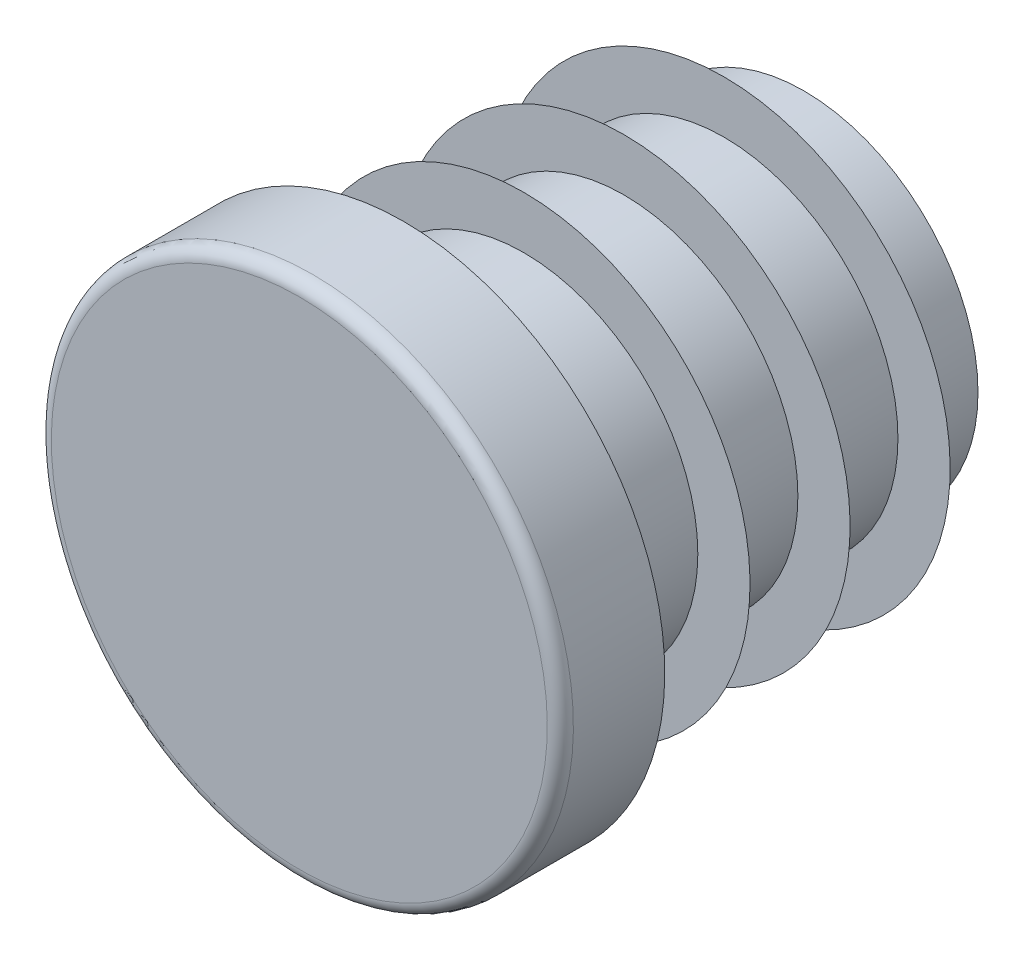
ISO-10303-21;
HEADER;
FILE_DESCRIPTION(('STEP AP214'),'2;1');
FILE_NAME('part.step','',(''),(''),'','','');
FILE_SCHEMA(('AUTOMOTIVE_DESIGN { 1 0 10303 214 1 1 1 1 }'));
ENDSEC;
DATA;
#1=APPLICATION_CONTEXT('core data for automotive mechanical design processes');
#2=APPLICATION_PROTOCOL_DEFINITION('international standard','automotive_design',2000,#1);
#3=PRODUCT_CONTEXT('',#1,'mechanical');
#4=PRODUCT('Part','Part','',(#3));
#5=PRODUCT_RELATED_PRODUCT_CATEGORY('part','',(#4));
#6=PRODUCT_DEFINITION_FORMATION('','',#4);
#7=PRODUCT_DEFINITION_CONTEXT('part definition',#1,'design');
#8=PRODUCT_DEFINITION('design','',#6,#7);
#9=PRODUCT_DEFINITION_SHAPE('','',#8);
#10=(LENGTH_UNIT() NAMED_UNIT(*) SI_UNIT(.MILLI.,.METRE.));
#11=(NAMED_UNIT(*) PLANE_ANGLE_UNIT() SI_UNIT($,.RADIAN.));
#12=(NAMED_UNIT(*) SI_UNIT($,.STERADIAN.) SOLID_ANGLE_UNIT());
#13=UNCERTAINTY_MEASURE_WITH_UNIT(LENGTH_MEASURE(1.E-05),#10,'distance_accuracy_value','');
#14=(GEOMETRIC_REPRESENTATION_CONTEXT(3) GLOBAL_UNCERTAINTY_ASSIGNED_CONTEXT((#13)) GLOBAL_UNIT_ASSIGNED_CONTEXT((#10,
#11,#12)) REPRESENTATION_CONTEXT('',''));
#15=CARTESIAN_POINT('',(0.,0.,0.));
#16=DIRECTION('',(0.,0.,1.));
#17=DIRECTION('',(1.,0.,0.));
#18=AXIS2_PLACEMENT_3D('',#15,#16,#17);
#19=CARTESIAN_POINT('',(0.,0.,3.));
#20=DIRECTION('',(0.,0.,-1.));
#21=DIRECTION('',(0.,1.,0.));
#22=AXIS2_PLACEMENT_3D('',#19,#20,#21);
#23=PLANE('',#22);
#24=CARTESIAN_POINT('',(0.,0.,3.));
#25=DIRECTION('',(0.,0.,-1.));
#26=DIRECTION('',(0.,1.,0.));
#27=AXIS2_PLACEMENT_3D('',#24,#25,#26);
#28=CIRCLE('',#27,7.125);
#29=CARTESIAN_POINT('',(0.,7.125,3.));
#30=VERTEX_POINT('',#29);
#31=EDGE_CURVE('E8',#30,#30,#28,.T.);
#32=ORIENTED_EDGE('',*,*,#31,.F.);
#33=EDGE_LOOP('',(#32));
#34=FACE_BOUND('',#33,.T.);
#35=ADVANCED_FACE('F12',(#34),#23,.F.);
#36=CARTESIAN_POINT('',(0.,0.,2.625));
#37=DIRECTION('',(0.,0.,-1.));
#38=DIRECTION('',(0.,1.,0.));
#39=AXIS2_PLACEMENT_3D('',#36,#37,#38);
#40=TOROIDAL_SURFACE('',#39,7.125,0.375);
#41=ORIENTED_EDGE('',*,*,#31,.T.);
#42=EDGE_LOOP('',(#41));
#43=FACE_BOUND('',#42,.T.);
#44=CARTESIAN_POINT('',(0.,0.,2.625));
#45=DIRECTION('',(0.,0.,-1.));
#46=DIRECTION('',(0.,1.,0.));
#47=AXIS2_PLACEMENT_3D('',#44,#45,#46);
#48=CIRCLE('',#47,7.5);
#49=CARTESIAN_POINT('',(0.,7.5,2.625));
#50=VERTEX_POINT('',#49);
#51=EDGE_CURVE('E18',#50,#50,#48,.T.);
#52=ORIENTED_EDGE('',*,*,#51,.F.);
#53=EDGE_LOOP('',(#52));
#54=FACE_BOUND('',#53,.T.);
#55=ADVANCED_FACE('F159',(#43,#54),#40,.T.);
#56=CARTESIAN_POINT('',(0.,0.,-11.5));
#57=DIRECTION('',(0.,0.,-1.));
#58=DIRECTION('',(0.,1.,0.));
#59=AXIS2_PLACEMENT_3D('',#56,#57,#58);
#60=CYLINDRICAL_SURFACE('',#59,7.5);
#61=CARTESIAN_POINT('',(0.,0.,0.));
#62=DIRECTION('',(0.,0.,-1.));
#63=DIRECTION('',(0.,1.,0.));
#64=AXIS2_PLACEMENT_3D('',#61,#62,#63);
#65=CIRCLE('',#64,7.5);
#66=CARTESIAN_POINT('',(0.,7.5,0.));
#67=VERTEX_POINT('',#66);
#68=EDGE_CURVE('E22',#67,#67,#65,.T.);
#69=ORIENTED_EDGE('',*,*,#68,.F.);
#70=EDGE_LOOP('',(#69));
#71=FACE_BOUND('',#70,.T.);
#72=ORIENTED_EDGE('',*,*,#51,.T.);
#73=EDGE_LOOP('',(#72));
#74=FACE_BOUND('',#73,.T.);
#75=ADVANCED_FACE('F154',(#71,#74),#60,.T.);
#76=CARTESIAN_POINT('',(7.5,0.,0.));
#77=DIRECTION('',(0.,0.,1.));
#78=DIRECTION('',(0.,-1.,0.));
#79=AXIS2_PLACEMENT_3D('',#76,#77,#78);
#80=PLANE('',#79);
#81=CARTESIAN_POINT('',(0.,0.,0.));
#82=DIRECTION('',(0.,0.,-1.));
#83=DIRECTION('',(0.,1.,0.));
#84=AXIS2_PLACEMENT_3D('',#81,#82,#83);
#85=CIRCLE('',#84,5.);
#86=CARTESIAN_POINT('',(0.,5.,0.));
#87=VERTEX_POINT('',#86);
#88=EDGE_CURVE('E26',#87,#87,#85,.T.);
#89=ORIENTED_EDGE('',*,*,#88,.F.);
#90=EDGE_LOOP('',(#89));
#91=FACE_BOUND('',#90,.T.);
#92=ORIENTED_EDGE('',*,*,#68,.T.);
#93=EDGE_LOOP('',(#92));
#94=FACE_BOUND('',#93,.T.);
#95=ADVANCED_FACE('F148',(#91,#94),#80,.F.);
#96=CARTESIAN_POINT('',(0.,0.,-11.5));
#97=DIRECTION('',(0.,0.,-1.));
#98=DIRECTION('',(0.,1.,0.));
#99=AXIS2_PLACEMENT_3D('',#96,#97,#98);
#100=CYLINDRICAL_SURFACE('',#99,5.);
#101=CARTESIAN_POINT('',(0.,0.,-0.575));
#102=DIRECTION('',(0.,0.,-1.));
#103=DIRECTION('',(0.,1.,0.));
#104=AXIS2_PLACEMENT_3D('',#101,#102,#103);
#105=CIRCLE('',#104,5.);
#106=CARTESIAN_POINT('',(0.,5.,-0.575));
#107=VERTEX_POINT('',#106);
#108=EDGE_CURVE('E31',#107,#107,#105,.T.);
#109=ORIENTED_EDGE('',*,*,#108,.F.);
#110=EDGE_LOOP('',(#109));
#111=FACE_BOUND('',#110,.T.);
#112=ORIENTED_EDGE('',*,*,#88,.T.);
#113=EDGE_LOOP('',(#112));
#114=FACE_BOUND('',#113,.T.);
#115=ADVANCED_FACE('F142',(#111,#114),#100,.T.);
#116=CARTESIAN_POINT('',(5.,0.,-0.575));
#117=DIRECTION('',(0.,0.,-1.));
#118=DIRECTION('',(0.,1.,0.));
#119=AXIS2_PLACEMENT_3D('',#116,#117,#118);
#120=PLANE('',#119);
#121=CARTESIAN_POINT('',(0.,0.,-0.575));
#122=DIRECTION('',(0.,0.,-1.));
#123=DIRECTION('',(0.,1.,0.));
#124=AXIS2_PLACEMENT_3D('',#121,#122,#123);
#125=CIRCLE('',#124,6.5);
#126=CARTESIAN_POINT('',(0.,6.5,-0.575));
#127=VERTEX_POINT('',#126);
#128=EDGE_CURVE('E34',#127,#127,#125,.T.);
#129=ORIENTED_EDGE('',*,*,#128,.F.);
#130=EDGE_LOOP('',(#129));
#131=FACE_BOUND('',#130,.T.);
#132=ORIENTED_EDGE('',*,*,#108,.T.);
#133=EDGE_LOOP('',(#132));
#134=FACE_BOUND('',#133,.T.);
#135=ADVANCED_FACE('F136',(#131,#134),#120,.F.);
#136=CARTESIAN_POINT('',(0.,0.,-0.575));
#137=DIRECTION('',(0.,0.,1.));
#138=DIRECTION('',(0.,-1.,0.));
#139=AXIS2_PLACEMENT_3D('',#136,#137,#138);
#140=CONICAL_SURFACE('',#139,6.5,0.959931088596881);
#141=CARTESIAN_POINT('',(0.,0.,-1.62531130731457));
#142=DIRECTION('',(0.,0.,-1.));
#143=DIRECTION('',(0.,1.,0.));
#144=AXIS2_PLACEMENT_3D('',#141,#142,#143);
#145=CIRCLE('',#144,5.);
#146=CARTESIAN_POINT('',(0.,5.,-1.62531130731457));
#147=VERTEX_POINT('',#146);
#148=EDGE_CURVE('E37',#147,#147,#145,.T.);
#149=ORIENTED_EDGE('',*,*,#148,.F.);
#150=EDGE_LOOP('',(#149));
#151=FACE_BOUND('',#150,.T.);
#152=ORIENTED_EDGE('',*,*,#128,.T.);
#153=EDGE_LOOP('',(#152));
#154=FACE_BOUND('',#153,.T.);
#155=ADVANCED_FACE('F130',(#151,#154),#140,.T.);
#156=CARTESIAN_POINT('',(0.,0.,-11.5));
#157=DIRECTION('',(0.,0.,-1.));
#158=DIRECTION('',(0.,1.,0.));
#159=AXIS2_PLACEMENT_3D('',#156,#157,#158);
#160=CYLINDRICAL_SURFACE('',#159,5.);
#161=CARTESIAN_POINT('',(0.,0.,-3.45));
#162=DIRECTION('',(0.,0.,-1.));
#163=DIRECTION('',(0.,1.,0.));
#164=AXIS2_PLACEMENT_3D('',#161,#162,#163);
#165=CIRCLE('',#164,5.);
#166=CARTESIAN_POINT('',(0.,5.,-3.45));
#167=VERTEX_POINT('',#166);
#168=EDGE_CURVE('E40',#167,#167,#165,.T.);
#169=ORIENTED_EDGE('',*,*,#168,.F.);
#170=EDGE_LOOP('',(#169));
#171=FACE_BOUND('',#170,.T.);
#172=ORIENTED_EDGE('',*,*,#148,.T.);
#173=EDGE_LOOP('',(#172));
#174=FACE_BOUND('',#173,.T.);
#175=ADVANCED_FACE('F124',(#171,#174),#160,.T.);
#176=CARTESIAN_POINT('',(5.,0.,-3.45));
#177=DIRECTION('',(0.,0.,-1.));
#178=DIRECTION('',(0.,1.,0.));
#179=AXIS2_PLACEMENT_3D('',#176,#177,#178);
#180=PLANE('',#179);
#181=CARTESIAN_POINT('',(0.,0.,-3.45));
#182=DIRECTION('',(0.,0.,-1.));
#183=DIRECTION('',(0.,1.,0.));
#184=AXIS2_PLACEMENT_3D('',#181,#182,#183);
#185=CIRCLE('',#184,6.5);
#186=CARTESIAN_POINT('',(0.,6.5,-3.45));
#187=VERTEX_POINT('',#186);
#188=EDGE_CURVE('E43',#187,#187,#185,.T.);
#189=ORIENTED_EDGE('',*,*,#188,.F.);
#190=EDGE_LOOP('',(#189));
#191=FACE_BOUND('',#190,.T.);
#192=ORIENTED_EDGE('',*,*,#168,.T.);
#193=EDGE_LOOP('',(#192));
#194=FACE_BOUND('',#193,.T.);
#195=ADVANCED_FACE('F118',(#191,#194),#180,.F.);
#196=CARTESIAN_POINT('',(0.,0.,-3.45));
#197=DIRECTION('',(0.,0.,1.));
#198=DIRECTION('',(0.,-1.,0.));
#199=AXIS2_PLACEMENT_3D('',#196,#197,#198);
#200=CONICAL_SURFACE('',#199,6.5,0.959931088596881);
#201=CARTESIAN_POINT('',(0.,0.,-4.50031130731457));
#202=DIRECTION('',(0.,0.,-1.));
#203=DIRECTION('',(0.,1.,0.));
#204=AXIS2_PLACEMENT_3D('',#201,#202,#203);
#205=CIRCLE('',#204,5.);
#206=CARTESIAN_POINT('',(0.,5.,-4.50031130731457));
#207=VERTEX_POINT('',#206);
#208=EDGE_CURVE('E46',#207,#207,#205,.T.);
#209=ORIENTED_EDGE('',*,*,#208,.F.);
#210=EDGE_LOOP('',(#209));
#211=FACE_BOUND('',#210,.T.);
#212=ORIENTED_EDGE('',*,*,#188,.T.);
#213=EDGE_LOOP('',(#212));
#214=FACE_BOUND('',#213,.T.);
#215=ADVANCED_FACE('F112',(#211,#214),#200,.T.);
#216=CARTESIAN_POINT('',(0.,0.,-11.5));
#217=DIRECTION('',(0.,0.,-1.));
#218=DIRECTION('',(0.,1.,0.));
#219=AXIS2_PLACEMENT_3D('',#216,#217,#218);
#220=CYLINDRICAL_SURFACE('',#219,5.);
#221=CARTESIAN_POINT('',(0.,0.,-6.325));
#222=DIRECTION('',(0.,0.,-1.));
#223=DIRECTION('',(0.,1.,0.));
#224=AXIS2_PLACEMENT_3D('',#221,#222,#223);
#225=CIRCLE('',#224,5.);
#226=CARTESIAN_POINT('',(0.,5.,-6.325));
#227=VERTEX_POINT('',#226);
#228=EDGE_CURVE('E49',#227,#227,#225,.T.);
#229=ORIENTED_EDGE('',*,*,#228,.F.);
#230=EDGE_LOOP('',(#229));
#231=FACE_BOUND('',#230,.T.);
#232=ORIENTED_EDGE('',*,*,#208,.T.);
#233=EDGE_LOOP('',(#232));
#234=FACE_BOUND('',#233,.T.);
#235=ADVANCED_FACE('F106',(#231,#234),#220,.T.);
#236=CARTESIAN_POINT('',(5.,0.,-6.325));
#237=DIRECTION('',(0.,0.,-1.));
#238=DIRECTION('',(0.,1.,0.));
#239=AXIS2_PLACEMENT_3D('',#236,#237,#238);
#240=PLANE('',#239);
#241=CARTESIAN_POINT('',(0.,0.,-6.325));
#242=DIRECTION('',(0.,0.,-1.));
#243=DIRECTION('',(0.,1.,0.));
#244=AXIS2_PLACEMENT_3D('',#241,#242,#243);
#245=CIRCLE('',#244,6.5);
#246=CARTESIAN_POINT('',(0.,6.5,-6.325));
#247=VERTEX_POINT('',#246);
#248=EDGE_CURVE('E52',#247,#247,#245,.T.);
#249=ORIENTED_EDGE('',*,*,#248,.F.);
#250=EDGE_LOOP('',(#249));
#251=FACE_BOUND('',#250,.T.);
#252=ORIENTED_EDGE('',*,*,#228,.T.);
#253=EDGE_LOOP('',(#252));
#254=FACE_BOUND('',#253,.T.);
#255=ADVANCED_FACE('F100',(#251,#254),#240,.F.);
#256=CARTESIAN_POINT('',(0.,0.,-6.325));
#257=DIRECTION('',(0.,0.,1.));
#258=DIRECTION('',(0.,-1.,0.));
#259=AXIS2_PLACEMENT_3D('',#256,#257,#258);
#260=CONICAL_SURFACE('',#259,6.5,0.959931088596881);
#261=CARTESIAN_POINT('',(0.,0.,-7.37531130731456));
#262=DIRECTION('',(0.,0.,-1.));
#263=DIRECTION('',(0.,1.,0.));
#264=AXIS2_PLACEMENT_3D('',#261,#262,#263);
#265=CIRCLE('',#264,5.);
#266=CARTESIAN_POINT('',(0.,5.,-7.37531130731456));
#267=VERTEX_POINT('',#266);
#268=EDGE_CURVE('E55',#267,#267,#265,.T.);
#269=ORIENTED_EDGE('',*,*,#268,.F.);
#270=EDGE_LOOP('',(#269));
#271=FACE_BOUND('',#270,.T.);
#272=ORIENTED_EDGE('',*,*,#248,.T.);
#273=EDGE_LOOP('',(#272));
#274=FACE_BOUND('',#273,.T.);
#275=ADVANCED_FACE('F94',(#271,#274),#260,.T.);
#276=CARTESIAN_POINT('',(0.,0.,-11.5));
#277=DIRECTION('',(0.,0.,-1.));
#278=DIRECTION('',(0.,1.,0.));
#279=AXIS2_PLACEMENT_3D('',#276,#277,#278);
#280=CYLINDRICAL_SURFACE('',#279,5.);
#281=CARTESIAN_POINT('',(0.,0.,-9.2));
#282=DIRECTION('',(0.,0.,-1.));
#283=DIRECTION('',(0.,1.,0.));
#284=AXIS2_PLACEMENT_3D('',#281,#282,#283);
#285=CIRCLE('',#284,5.);
#286=CARTESIAN_POINT('',(0.,5.,-9.2));
#287=VERTEX_POINT('',#286);
#288=EDGE_CURVE('E58',#287,#287,#285,.T.);
#289=ORIENTED_EDGE('',*,*,#288,.F.);
#290=EDGE_LOOP('',(#289));
#291=FACE_BOUND('',#290,.T.);
#292=ORIENTED_EDGE('',*,*,#268,.T.);
#293=EDGE_LOOP('',(#292));
#294=FACE_BOUND('',#293,.T.);
#295=ADVANCED_FACE('F88',(#291,#294),#280,.T.);
#296=CARTESIAN_POINT('',(5.,0.,-9.2));
#297=DIRECTION('',(0.,0.,-1.));
#298=DIRECTION('',(0.,1.,0.));
#299=AXIS2_PLACEMENT_3D('',#296,#297,#298);
#300=PLANE('',#299);
#301=CARTESIAN_POINT('',(0.,0.,-9.2));
#302=DIRECTION('',(0.,0.,-1.));
#303=DIRECTION('',(0.,1.,0.));
#304=AXIS2_PLACEMENT_3D('',#301,#302,#303);
#305=CIRCLE('',#304,6.5);
#306=CARTESIAN_POINT('',(0.,6.5,-9.2));
#307=VERTEX_POINT('',#306);
#308=EDGE_CURVE('E61',#307,#307,#305,.T.);
#309=ORIENTED_EDGE('',*,*,#308,.F.);
#310=EDGE_LOOP('',(#309));
#311=FACE_BOUND('',#310,.T.);
#312=ORIENTED_EDGE('',*,*,#288,.T.);
#313=EDGE_LOOP('',(#312));
#314=FACE_BOUND('',#313,.T.);
#315=ADVANCED_FACE('F82',(#311,#314),#300,.F.);
#316=CARTESIAN_POINT('',(0.,0.,-9.2));
#317=DIRECTION('',(0.,0.,1.));
#318=DIRECTION('',(0.,-1.,0.));
#319=AXIS2_PLACEMENT_3D('',#316,#317,#318);
#320=CONICAL_SURFACE('',#319,6.5,0.959931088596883);
#321=CARTESIAN_POINT('',(0.,0.,-10.2503113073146));
#322=DIRECTION('',(0.,0.,-1.));
#323=DIRECTION('',(0.,1.,0.));
#324=AXIS2_PLACEMENT_3D('',#321,#322,#323);
#325=CIRCLE('',#324,5.);
#326=CARTESIAN_POINT('',(0.,5.,-10.2503113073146));
#327=VERTEX_POINT('',#326);
#328=EDGE_CURVE('E64',#327,#327,#325,.T.);
#329=ORIENTED_EDGE('',*,*,#328,.F.);
#330=EDGE_LOOP('',(#329));
#331=FACE_BOUND('',#330,.T.);
#332=ORIENTED_EDGE('',*,*,#308,.T.);
#333=EDGE_LOOP('',(#332));
#334=FACE_BOUND('',#333,.T.);
#335=ADVANCED_FACE('F76',(#331,#334),#320,.T.);
#336=CARTESIAN_POINT('',(0.,0.,-11.5));
#337=DIRECTION('',(0.,0.,-1.));
#338=DIRECTION('',(0.,1.,0.));
#339=AXIS2_PLACEMENT_3D('',#336,#337,#338);
#340=CYLINDRICAL_SURFACE('',#339,5.);
#341=CARTESIAN_POINT('',(0.,0.,-11.5));
#342=DIRECTION('',(0.,0.,-1.));
#343=DIRECTION('',(0.,1.,0.));
#344=AXIS2_PLACEMENT_3D('',#341,#342,#343);
#345=CIRCLE('',#344,5.);
#346=CARTESIAN_POINT('',(0.,5.,-11.5));
#347=VERTEX_POINT('',#346);
#348=EDGE_CURVE('E67',#347,#347,#345,.T.);
#349=ORIENTED_EDGE('',*,*,#348,.F.);
#350=EDGE_LOOP('',(#349));
#351=FACE_BOUND('',#350,.T.);
#352=ORIENTED_EDGE('',*,*,#328,.T.);
#353=EDGE_LOOP('',(#352));
#354=FACE_BOUND('',#353,.T.);
#355=ADVANCED_FACE('F73',(#351,#354),#340,.T.);
#356=CARTESIAN_POINT('',(5.,0.,-11.5));
#357=DIRECTION('',(0.,0.,1.));
#358=DIRECTION('',(0.,-1.,0.));
#359=AXIS2_PLACEMENT_3D('',#356,#357,#358);
#360=PLANE('',#359);
#361=ORIENTED_EDGE('',*,*,#348,.T.);
#362=EDGE_LOOP('',(#361));
#363=FACE_BOUND('',#362,.T.);
#364=ADVANCED_FACE('F71',(#363),#360,.F.);
#365=CLOSED_SHELL('',(#35,#55,#75,#95,#115,#135,#155,#175,#195,#215,#235,#255,#275,#295,#315,
#335,#355,#364));
#366=MANIFOLD_SOLID_BREP('B1',#365);
#367=ADVANCED_BREP_SHAPE_REPRESENTATION('',(#18,#366),#14);
#368=SHAPE_DEFINITION_REPRESENTATION(#9,#367);
ENDSEC;
END-ISO-10303-21;
